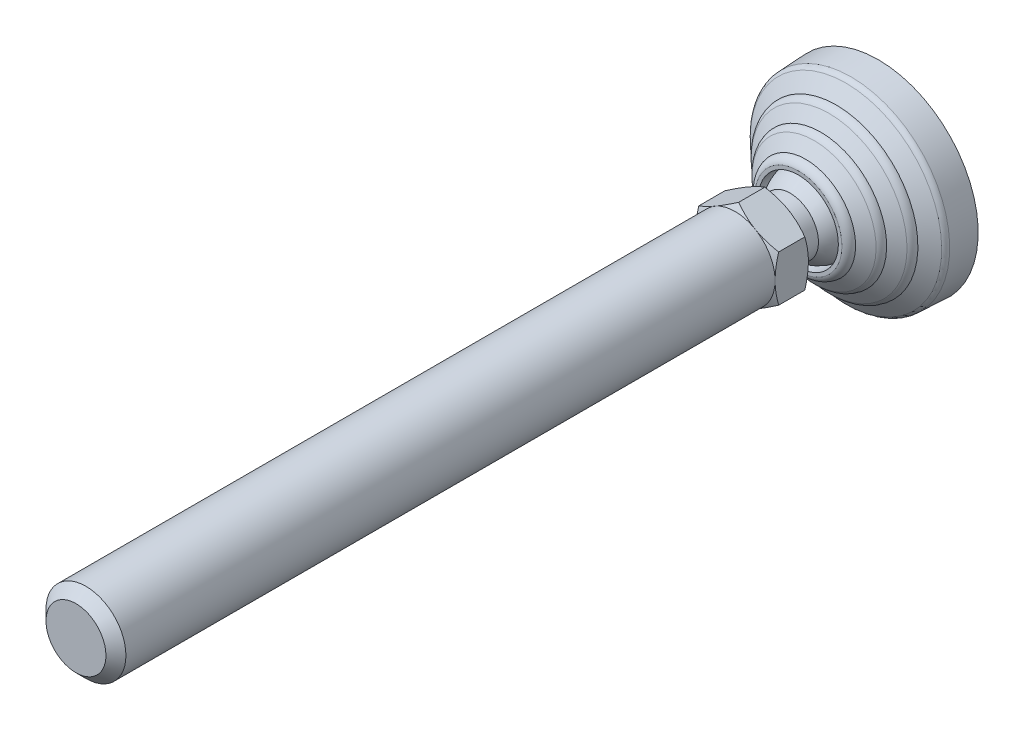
ISO-10303-21;
HEADER;
FILE_DESCRIPTION(('STEP AP214'),'2;1');
FILE_NAME('part.step','',(''),(''),'','','');
FILE_SCHEMA(('AUTOMOTIVE_DESIGN { 1 0 10303 214 1 1 1 1 }'));
ENDSEC;
DATA;
#1=APPLICATION_CONTEXT('core data for automotive mechanical design processes');
#2=APPLICATION_PROTOCOL_DEFINITION('international standard','automotive_design',2000,#1);
#3=PRODUCT_CONTEXT('',#1,'mechanical');
#4=PRODUCT('Part','Part','',(#3));
#5=PRODUCT_RELATED_PRODUCT_CATEGORY('part','',(#4));
#6=PRODUCT_DEFINITION_FORMATION('','',#4);
#7=PRODUCT_DEFINITION_CONTEXT('part definition',#1,'design');
#8=PRODUCT_DEFINITION('design','',#6,#7);
#9=PRODUCT_DEFINITION_SHAPE('','',#8);
#10=(LENGTH_UNIT() NAMED_UNIT(*) SI_UNIT(.MILLI.,.METRE.));
#11=(NAMED_UNIT(*) PLANE_ANGLE_UNIT() SI_UNIT($,.RADIAN.));
#12=(NAMED_UNIT(*) SI_UNIT($,.STERADIAN.) SOLID_ANGLE_UNIT());
#13=UNCERTAINTY_MEASURE_WITH_UNIT(LENGTH_MEASURE(1.E-05),#10,'distance_accuracy_value','');
#14=(GEOMETRIC_REPRESENTATION_CONTEXT(3) GLOBAL_UNCERTAINTY_ASSIGNED_CONTEXT((#13)) GLOBAL_UNIT_ASSIGNED_CONTEXT((#10,
#11,#12)) REPRESENTATION_CONTEXT('',''));
#15=CARTESIAN_POINT('',(0.,0.,0.));
#16=DIRECTION('',(0.,0.,1.));
#17=DIRECTION('',(1.,0.,0.));
#18=AXIS2_PLACEMENT_3D('',#15,#16,#17);
#19=CARTESIAN_POINT('',(0.,0.,30.));
#20=DIRECTION('',(0.,0.,-1.));
#21=DIRECTION('',(0.,1.,0.));
#22=AXIS2_PLACEMENT_3D('',#19,#20,#21);
#23=CYLINDRICAL_SURFACE('',#22,12.);
#24=CARTESIAN_POINT('',(-12.,0.,18.));
#25=CARTESIAN_POINT('',(-12.0000041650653,-0.196349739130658,18.));
#26=CARTESIAN_POINT('',(-11.9951810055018,-0.392699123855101,18.));
#27=CARTESIAN_POINT('',(-11.9759099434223,-0.784925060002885,18.));
#28=CARTESIAN_POINT('',(-11.9614620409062,-0.980801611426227,18.));
#29=CARTESIAN_POINT('',(-11.9229713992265,-1.37160975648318,18.));
#30=CARTESIAN_POINT('',(-11.8989286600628,-1.5665413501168,18.));
#31=CARTESIAN_POINT('',(-11.841307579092,-1.95499003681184,18.));
#32=CARTESIAN_POINT('',(-11.8077292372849,-2.14850712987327,18.));
#33=CARTESIAN_POINT('',(-11.7311174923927,-2.53366059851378,18.));
#34=CARTESIAN_POINT('',(-11.6880840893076,-2.72529697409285,18.));
#35=CARTESIAN_POINT('',(-11.5926659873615,-3.10622734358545,18.));
#36=CARTESIAN_POINT('',(-11.5402812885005,-3.29552133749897,18.));
#37=CARTESIAN_POINT('',(-11.4262867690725,-3.67131091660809,18.));
#38=CARTESIAN_POINT('',(-11.3646769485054,-3.85780650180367,18.));
#39=CARTESIAN_POINT('',(-11.2323806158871,-4.22754997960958,18.));
#40=CARTESIAN_POINT('',(-11.1616941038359,-4.41079787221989,18.));
#41=CARTESIAN_POINT('',(-11.011414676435,-4.77360450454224,18.));
#42=CARTESIAN_POINT('',(-10.9318217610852,-4.95316324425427,18.));
#43=CARTESIAN_POINT('',(-10.7639212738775,-5.30815899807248,18.));
#44=CARTESIAN_POINT('',(-10.6756137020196,-5.48359601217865,18.));
#45=CARTESIAN_POINT('',(-10.4904966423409,-5.82992567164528,17.9999999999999));
#46=CARTESIAN_POINT('',(-10.3936871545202,-6.00081831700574,17.9999999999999));
#47=CARTESIAN_POINT('',(-10.1917994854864,-6.33764754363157,17.9999999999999));
#48=CARTESIAN_POINT('',(-10.0867213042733,-6.50358412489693,17.9999999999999));
#49=CARTESIAN_POINT('',(-9.8685493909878,-6.83010146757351,17.9999999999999));
#50=CARTESIAN_POINT('',(-9.75545565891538,-6.99068222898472,17.9999999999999));
#51=CARTESIAN_POINT('',(-9.5215250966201,-7.30610107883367,17.9999999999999));
#52=CARTESIAN_POINT('',(-9.40068826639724,-7.4609391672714,17.9999999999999));
#53=CARTESIAN_POINT('',(-9.15156261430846,-7.76449965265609,17.9999999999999));
#54=CARTESIAN_POINT('',(-9.02327379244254,-7.91322204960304,17.9999999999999));
#55=CARTESIAN_POINT('',(-8.75955321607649,-8.20419286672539,17.9999999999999));
#56=CARTESIAN_POINT('',(-8.62412146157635,-8.3464412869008,17.9999999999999));
#57=CARTESIAN_POINT('',(-8.3464412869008,-8.62412146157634,17.9999999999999));
#58=CARTESIAN_POINT('',(-8.2041928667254,-8.75955321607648,17.9999999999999));
#59=CARTESIAN_POINT('',(-7.91322204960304,-9.02327379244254,17.9999999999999));
#60=CARTESIAN_POINT('',(-7.76449965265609,-9.15156261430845,17.9999999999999));
#61=CARTESIAN_POINT('',(-7.4609391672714,-9.40068826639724,17.9999999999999));
#62=CARTESIAN_POINT('',(-7.30610107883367,-9.5215250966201,17.9999999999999));
#63=CARTESIAN_POINT('',(-6.99068222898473,-9.75545565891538,17.9999999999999));
#64=CARTESIAN_POINT('',(-6.83010146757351,-9.8685493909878,17.9999999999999));
#65=CARTESIAN_POINT('',(-6.50358412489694,-10.0867213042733,17.9999999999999));
#66=CARTESIAN_POINT('',(-6.33764754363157,-10.1917994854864,17.9999999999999));
#67=CARTESIAN_POINT('',(-6.00081831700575,-10.3936871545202,17.9999999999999));
#68=CARTESIAN_POINT('',(-5.82992567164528,-10.4904966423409,17.9999999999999));
#69=CARTESIAN_POINT('',(-5.48359601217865,-10.6756137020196,17.9999999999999));
#70=CARTESIAN_POINT('',(-5.30815899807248,-10.7639212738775,17.9999999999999));
#71=CARTESIAN_POINT('',(-4.95316324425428,-10.9318217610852,17.9999999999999));
#72=CARTESIAN_POINT('',(-4.77360450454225,-11.011414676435,17.9999999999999));
#73=CARTESIAN_POINT('',(-4.4107978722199,-11.1616941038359,17.9999999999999));
#74=CARTESIAN_POINT('',(-4.22754997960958,-11.2323806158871,17.9999999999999));
#75=CARTESIAN_POINT('',(-3.85780650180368,-11.3646769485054,17.9999999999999));
#76=CARTESIAN_POINT('',(-3.67131091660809,-11.4262867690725,17.9999999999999));
#77=CARTESIAN_POINT('',(-3.29552133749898,-11.5402812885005,17.9999999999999));
#78=CARTESIAN_POINT('',(-3.10622734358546,-11.5926659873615,17.9999999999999));
#79=CARTESIAN_POINT('',(-2.72529697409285,-11.6880840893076,17.9999999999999));
#80=CARTESIAN_POINT('',(-2.53366059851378,-11.7311174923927,17.9999999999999));
#81=CARTESIAN_POINT('',(-2.14850712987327,-11.8077292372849,17.9999999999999));
#82=CARTESIAN_POINT('',(-1.95499003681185,-11.841307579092,17.9999999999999));
#83=CARTESIAN_POINT('',(-1.5665413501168,-11.8989286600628,17.9999999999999));
#84=CARTESIAN_POINT('',(-1.37160975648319,-11.9229713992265,17.9999999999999));
#85=CARTESIAN_POINT('',(-0.980801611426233,-11.9614620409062,17.9999999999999));
#86=CARTESIAN_POINT('',(-0.78492506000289,-11.9759099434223,17.9999999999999));
#87=CARTESIAN_POINT('',(-0.392699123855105,-11.9951810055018,17.9999999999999));
#88=CARTESIAN_POINT('',(-0.196349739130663,-12.0000041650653,17.9999999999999));
#89=CARTESIAN_POINT('',(0.,-12.,17.9999999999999));
#90=B_SPLINE_CURVE_WITH_KNOTS('',3,(#24,#25,#26,#27,#28,#29,#30,#31,#32,#33,#34,#35,#36,#37,#38,
#39,#40,#41,#42,#43,#44,#45,#46,#47,#48,#49,#50,#51,#52,#53,#54,#55,#56,#57,#58,#59,#60,#61,#62,
#63,#64,#65,#66,#67,#68,#69,#70,#71,#72,#73,#74,#75,#76,#77,#78,#79,#80,#81,#82,#83,#84,#85,#86,
#87,#88,#89),.UNSPECIFIED.,.F.,.F.,(4,2,2,2,2,2,2,2,2,2,2,2,2,2,2,2,2,2,2,2,2,2,2,2,2,2,2,2,2,2,
2,2,4),(0.,0.588989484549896,1.17797896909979,1.76696845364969,2.35595793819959,
2.94494742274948,3.53393690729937,4.12292639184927,4.71191587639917,5.30090536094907,
5.88989484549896,6.47888433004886,7.06787381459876,7.65686329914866,8.24585278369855,
8.83484226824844,9.42383175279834,10.0128212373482,10.6018107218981,11.190800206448,
11.7797896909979,12.3687791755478,12.9577686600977,13.5467581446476,14.1357476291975,
14.7247371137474,15.3137265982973,15.9027160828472,16.4917055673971,17.080695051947,
17.6696845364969,18.2586740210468,18.8476635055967),.UNSPECIFIED.);
#91=CARTESIAN_POINT('',(-12.,0.,18.00017943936));
#92=VERTEX_POINT('',#91);
#93=CARTESIAN_POINT('',(0.,-12.,18.));
#94=VERTEX_POINT('',#93);
#95=EDGE_CURVE('E138',#92,#94,#90,.T.);
#96=ORIENTED_EDGE('',*,*,#95,.F.);
#97=CARTESIAN_POINT('',(0.,0.,18.));
#98=DIRECTION('',(0.,0.,-1.));
#99=DIRECTION('',(0.,1.,0.));
#100=AXIS2_PLACEMENT_3D('',#97,#98,#99);
#101=CIRCLE('',#100,12.);
#102=CARTESIAN_POINT('',(0.,12.,18.));
#103=VERTEX_POINT('',#102);
#104=EDGE_CURVE('E134',#103,#92,#101,.F.);
#105=ORIENTED_EDGE('',*,*,#104,.F.);
#106=CARTESIAN_POINT('',(12.,0.,18.));
#107=CARTESIAN_POINT('',(12.0000041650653,0.196349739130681,18.));
#108=CARTESIAN_POINT('',(11.9951810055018,0.392699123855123,18.));
#109=CARTESIAN_POINT('',(11.9759099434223,0.784925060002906,18.));
#110=CARTESIAN_POINT('',(11.9614620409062,0.980801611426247,18.));
#111=CARTESIAN_POINT('',(11.9229713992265,1.3716097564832,18.));
#112=CARTESIAN_POINT('',(11.8989286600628,1.56654135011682,18.));
#113=CARTESIAN_POINT('',(11.841307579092,1.95499003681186,18.));
#114=CARTESIAN_POINT('',(11.8077292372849,2.14850712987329,18.));
#115=CARTESIAN_POINT('',(11.7311174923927,2.53366059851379,18.));
#116=CARTESIAN_POINT('',(11.6880840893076,2.72529697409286,18.));
#117=CARTESIAN_POINT('',(11.5926659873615,3.10622734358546,18.));
#118=CARTESIAN_POINT('',(11.5402812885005,3.29552133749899,18.));
#119=CARTESIAN_POINT('',(11.4262867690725,3.6713109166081,18.));
#120=CARTESIAN_POINT('',(11.3646769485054,3.85780650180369,18.));
#121=CARTESIAN_POINT('',(11.2323806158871,4.22754997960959,18.));
#122=CARTESIAN_POINT('',(11.1616941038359,4.4107978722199,18.));
#123=CARTESIAN_POINT('',(11.011414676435,4.77360450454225,18.));
#124=CARTESIAN_POINT('',(10.9318217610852,4.95316324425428,18.));
#125=CARTESIAN_POINT('',(10.7639212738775,5.30815899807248,18.));
#126=CARTESIAN_POINT('',(10.6756137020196,5.48359601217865,18.));
#127=CARTESIAN_POINT('',(10.4904966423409,5.82992567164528,18.));
#128=CARTESIAN_POINT('',(10.3936871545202,6.00081831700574,18.));
#129=CARTESIAN_POINT('',(10.1917994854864,6.33764754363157,18.));
#130=CARTESIAN_POINT('',(10.0867213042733,6.50358412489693,18.));
#131=CARTESIAN_POINT('',(9.8685493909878,6.83010146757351,18.));
#132=CARTESIAN_POINT('',(9.75545565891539,6.99068222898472,18.));
#133=CARTESIAN_POINT('',(9.5215250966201,7.30610107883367,18.));
#134=CARTESIAN_POINT('',(9.40068826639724,7.4609391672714,18.));
#135=CARTESIAN_POINT('',(9.15156261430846,7.76449965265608,18.));
#136=CARTESIAN_POINT('',(9.02327379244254,7.91322204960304,18.));
#137=CARTESIAN_POINT('',(8.75955321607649,8.20419286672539,18.));
#138=CARTESIAN_POINT('',(8.62412146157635,8.3464412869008,18.));
#139=CARTESIAN_POINT('',(8.34644128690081,8.62412146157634,18.));
#140=CARTESIAN_POINT('',(8.20419286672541,8.75955321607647,18.));
#141=CARTESIAN_POINT('',(7.91322204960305,9.02327379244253,18.));
#142=CARTESIAN_POINT('',(7.7644996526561,9.15156261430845,18.));
#143=CARTESIAN_POINT('',(7.46093916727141,9.40068826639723,18.));
#144=CARTESIAN_POINT('',(7.30610107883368,9.52152509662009,18.));
#145=CARTESIAN_POINT('',(6.99068222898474,9.75545565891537,18.));
#146=CARTESIAN_POINT('',(6.83010146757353,9.86854939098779,18.));
#147=CARTESIAN_POINT('',(6.50358412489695,10.0867213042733,18.));
#148=CARTESIAN_POINT('',(6.33764754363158,10.1917994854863,18.));
#149=CARTESIAN_POINT('',(6.00081831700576,10.3936871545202,18.));
#150=CARTESIAN_POINT('',(5.8299256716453,10.4904966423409,18.));
#151=CARTESIAN_POINT('',(5.48359601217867,10.6756137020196,18.));
#152=CARTESIAN_POINT('',(5.3081589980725,10.7639212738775,18.));
#153=CARTESIAN_POINT('',(4.9531632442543,10.9318217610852,18.));
#154=CARTESIAN_POINT('',(4.77360450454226,11.0114146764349,18.));
#155=CARTESIAN_POINT('',(4.41079787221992,11.1616941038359,18.));
#156=CARTESIAN_POINT('',(4.2275499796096,11.2323806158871,18.));
#157=CARTESIAN_POINT('',(3.85780650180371,11.3646769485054,18.));
#158=CARTESIAN_POINT('',(3.67131091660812,11.4262867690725,18.));
#159=CARTESIAN_POINT('',(3.29552133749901,11.5402812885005,18.));
#160=CARTESIAN_POINT('',(3.10622734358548,11.5926659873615,18.));
#161=CARTESIAN_POINT('',(2.72529697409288,11.6880840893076,18.));
#162=CARTESIAN_POINT('',(2.53366059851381,11.7311174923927,18.));
#163=CARTESIAN_POINT('',(2.1485071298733,11.8077292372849,18.));
#164=CARTESIAN_POINT('',(1.95499003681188,11.841307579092,18.));
#165=CARTESIAN_POINT('',(1.56654135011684,11.8989286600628,18.));
#166=CARTESIAN_POINT('',(1.37160975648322,11.9229713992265,18.));
#167=CARTESIAN_POINT('',(0.980801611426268,11.9614620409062,18.));
#168=CARTESIAN_POINT('',(0.784925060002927,11.9759099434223,18.));
#169=CARTESIAN_POINT('',(0.392699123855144,11.9951810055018,18.));
#170=CARTESIAN_POINT('',(0.196349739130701,12.0000041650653,18.));
#171=CARTESIAN_POINT('',(0.,12.,18.));
#172=B_SPLINE_CURVE_WITH_KNOTS('',3,(#106,#107,#108,#109,#110,#111,#112,#113,#114,#115,#116,
#117,#118,#119,#120,#121,#122,#123,#124,#125,#126,#127,#128,#129,#130,#131,#132,#133,#134,#135,
#136,#137,#138,#139,#140,#141,#142,#143,#144,#145,#146,#147,#148,#149,#150,#151,#152,#153,#154,
#155,#156,#157,#158,#159,#160,#161,#162,#163,#164,#165,#166,#167,#168,#169,#170,#171),
.UNSPECIFIED.,.F.,.F.,(4,2,2,2,2,2,2,2,2,2,2,2,2,2,2,2,2,2,2,2,2,2,2,2,2,2,2,2,2,2,2,2,4),(0.,
0.588989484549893,1.17797896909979,1.76696845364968,2.35595793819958,2.94494742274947,
3.53393690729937,4.12292639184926,4.71191587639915,5.30090536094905,5.88989484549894,
6.47888433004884,7.06787381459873,7.65686329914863,8.24585278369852,8.83484226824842,
9.42383175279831,10.0128212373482,10.6018107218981,11.190800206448,11.7797896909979,
12.3687791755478,12.9577686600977,13.5467581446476,14.1357476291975,14.7247371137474,
15.3137265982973,15.9027160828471,16.491705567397,17.0806950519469,17.6696845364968,
18.2586740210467,18.8476635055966),.UNSPECIFIED.);
#173=CARTESIAN_POINT('',(12.,0.,18.));
#174=VERTEX_POINT('',#173);
#175=EDGE_CURVE('E31',#174,#103,#172,.T.);
#176=ORIENTED_EDGE('',*,*,#175,.F.);
#177=CARTESIAN_POINT('',(0.,0.,18.));
#178=DIRECTION('',(0.,0.,-1.));
#179=DIRECTION('',(0.,1.,0.));
#180=AXIS2_PLACEMENT_3D('',#177,#178,#179);
#181=CIRCLE('',#180,12.);
#182=EDGE_CURVE('E135',#94,#174,#181,.F.);
#183=ORIENTED_EDGE('',*,*,#182,.F.);
#184=EDGE_LOOP('',(#96,#105,#176,#183));
#185=FACE_BOUND('',#184,.T.);
#186=CARTESIAN_POINT('',(0.,0.,24.));
#187=DIRECTION('',(0.,0.,-1.));
#188=DIRECTION('',(0.,1.,0.));
#189=AXIS2_PLACEMENT_3D('',#186,#187,#188);
#190=CIRCLE('',#189,12.);
#191=CARTESIAN_POINT('',(0.,12.,24.));
#192=VERTEX_POINT('',#191);
#193=EDGE_CURVE('E155',#192,#192,#190,.T.);
#194=ORIENTED_EDGE('',*,*,#193,.F.);
#195=EDGE_LOOP('',(#194));
#196=FACE_BOUND('',#195,.T.);
#197=ADVANCED_FACE('F14',(#185,#196),#23,.F.);
#198=CARTESIAN_POINT('',(-6.53226682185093,0.,24.));
#199=DIRECTION('',(0.,0.,1.));
#200=DIRECTION('',(-1.,0.,0.));
#201=AXIS2_PLACEMENT_3D('',#198,#199,#200);
#202=PLANE('',#201);
#203=CARTESIAN_POINT('',(0.,0.,24.));
#204=DIRECTION('',(0.,0.,-1.));
#205=DIRECTION('',(0.,1.,0.));
#206=AXIS2_PLACEMENT_3D('',#203,#204,#205);
#207=CIRCLE('',#206,13.0645336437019);
#208=CARTESIAN_POINT('',(0.,13.0645336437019,24.));
#209=VERTEX_POINT('',#208);
#210=EDGE_CURVE('E151',#209,#209,#207,.T.);
#211=ORIENTED_EDGE('',*,*,#210,.F.);
#212=EDGE_LOOP('',(#211));
#213=FACE_BOUND('',#212,.T.);
#214=ORIENTED_EDGE('',*,*,#193,.T.);
#215=EDGE_LOOP('',(#214));
#216=FACE_BOUND('',#215,.T.);
#217=ADVANCED_FACE('F304',(#213,#216),#202,.T.);
#218=CARTESIAN_POINT('',(0.,0.,21.5842));
#219=DIRECTION('',(0.,0.,-1.));
#220=DIRECTION('',(0.,1.,0.));
#221=AXIS2_PLACEMENT_3D('',#218,#219,#220);
#222=TOROIDAL_SURFACE('',#221,12.5253,2.47525);
#223=ORIENTED_EDGE('',*,*,#210,.T.);
#224=EDGE_LOOP('',(#223));
#225=FACE_BOUND('',#224,.T.);
#226=CARTESIAN_POINT('',(0.,0.,21.8062186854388));
#227=DIRECTION('',(0.,0.,-1.));
#228=DIRECTION('',(-1.,0.,0.));
#229=AXIS2_PLACEMENT_3D('',#226,#227,#228);
#230=CIRCLE('',#229,14.9905728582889);
#231=CARTESIAN_POINT('',(-14.9905728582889,0.,21.8062186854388));
#232=VERTEX_POINT('',#231);
#233=EDGE_CURVE('E154',#232,#232,#230,.T.);
#234=ORIENTED_EDGE('',*,*,#233,.F.);
#235=EDGE_LOOP('',(#234));
#236=FACE_BOUND('',#235,.T.);
#237=ADVANCED_FACE('F382',(#225,#236),#222,.T.);
#238=CARTESIAN_POINT('',(0.,0.,19.3004110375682));
#239=DIRECTION('',(0.,0.,-1.));
#240=DIRECTION('',(0.,1.,0.));
#241=AXIS2_PLACEMENT_3D('',#238,#239,#240);
#242=CONICAL_SURFACE('',#241,18.63040749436,0.967870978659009);
#243=ORIENTED_EDGE('',*,*,#233,.T.);
#244=EDGE_LOOP('',(#243));
#245=FACE_BOUND('',#244,.T.);
#246=CARTESIAN_POINT('',(0.,0.,19.3004110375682));
#247=DIRECTION('',(0.,0.,-1.));
#248=DIRECTION('',(0.,1.,0.));
#249=AXIS2_PLACEMENT_3D('',#246,#247,#248);
#250=CIRCLE('',#249,18.63040749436);
#251=CARTESIAN_POINT('',(0.,18.63040749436,19.3004110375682));
#252=VERTEX_POINT('',#251);
#253=EDGE_CURVE('E376',#252,#252,#250,.T.);
#254=ORIENTED_EDGE('',*,*,#253,.F.);
#255=EDGE_LOOP('',(#254));
#256=FACE_BOUND('',#255,.T.);
#257=ADVANCED_FACE('F369',(#245,#256),#242,.T.);
#258=CARTESIAN_POINT('',(0.,0.,17.149417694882));
#259=DIRECTION('',(0.,0.,-1.));
#260=DIRECTION('',(0.,1.,0.));
#261=AXIS2_PLACEMENT_3D('',#258,#259,#260);
#262=TOROIDAL_SURFACE('',#261,17.1699621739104,2.59993709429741);
#263=CARTESIAN_POINT('',(0.,0.,17.266146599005));
#264=DIRECTION('',(0.,0.,-1.));
#265=DIRECTION('',(-1.,0.,0.));
#266=AXIS2_PLACEMENT_3D('',#263,#264,#265);
#267=CIRCLE('',#266,19.7672775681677);
#268=CARTESIAN_POINT('',(-19.7672775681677,0.,17.266146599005));
#269=VERTEX_POINT('',#268);
#270=EDGE_CURVE('E373',#269,#269,#267,.T.);
#271=ORIENTED_EDGE('',*,*,#270,.F.);
#272=EDGE_LOOP('',(#271));
#273=FACE_BOUND('',#272,.T.);
#274=ORIENTED_EDGE('',*,*,#253,.T.);
#275=EDGE_LOOP('',(#274));
#276=FACE_BOUND('',#275,.T.);
#277=ADVANCED_FACE('F365',(#273,#276),#262,.T.);
#278=CARTESIAN_POINT('',(0.,0.,14.7704000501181));
#279=DIRECTION('',(0.,0.,-1.));
#280=DIRECTION('',(0.,1.,0.));
#281=AXIS2_PLACEMENT_3D('',#278,#279,#280);
#282=CONICAL_SURFACE('',#281,23.3925000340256,0.967871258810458);
#283=CARTESIAN_POINT('',(0.,0.,14.7704000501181));
#284=DIRECTION('',(0.,0.,-1.));
#285=DIRECTION('',(0.,1.,0.));
#286=AXIS2_PLACEMENT_3D('',#283,#284,#285);
#287=CIRCLE('',#286,23.3925000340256);
#288=CARTESIAN_POINT('',(0.,23.3925000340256,14.7704000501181));
#289=VERTEX_POINT('',#288);
#290=EDGE_CURVE('E354',#289,#289,#287,.T.);
#291=ORIENTED_EDGE('',*,*,#290,.F.);
#292=EDGE_LOOP('',(#291));
#293=FACE_BOUND('',#292,.T.);
#294=ORIENTED_EDGE('',*,*,#270,.T.);
#295=EDGE_LOOP('',(#294));
#296=FACE_BOUND('',#295,.T.);
#297=ADVANCED_FACE('F361',(#293,#296),#282,.T.);
#298=CARTESIAN_POINT('',(0.,0.,12.6193000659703));
#299=DIRECTION('',(0.,0.,-1.));
#300=DIRECTION('',(0.,1.,0.));
#301=AXIS2_PLACEMENT_3D('',#298,#299,#300);
#302=TOROIDAL_SURFACE('',#301,21.9321002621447,2.59999973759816);
#303=ORIENTED_EDGE('',*,*,#290,.T.);
#304=EDGE_LOOP('',(#303));
#305=FACE_BOUND('',#304,.T.);
#306=CARTESIAN_POINT('',(0.,0.,12.6295138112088));
#307=DIRECTION('',(0.,0.,-1.));
#308=DIRECTION('',(-1.,0.,0.));
#309=AXIS2_PLACEMENT_3D('',#306,#307,#308);
#310=CIRCLE('',#309,24.5320799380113);
#311=CARTESIAN_POINT('',(-24.5320799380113,0.,12.6295138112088));
#312=VERTEX_POINT('',#311);
#313=EDGE_CURVE('E351',#312,#312,#310,.T.);
#314=ORIENTED_EDGE('',*,*,#313,.F.);
#315=EDGE_LOOP('',(#314));
#316=FACE_BOUND('',#315,.T.);
#317=ADVANCED_FACE('F358',(#305,#316),#302,.T.);
#318=CARTESIAN_POINT('',(0.,0.,9.71835625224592));
#319=DIRECTION('',(0.,0.,-1.));
#320=DIRECTION('',(0.,1.,0.));
#321=AXIS2_PLACEMENT_3D('',#318,#319,#320);
#322=CONICAL_SURFACE('',#321,28.760790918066,0.967879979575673);
#323=ORIENTED_EDGE('',*,*,#313,.T.);
#324=EDGE_LOOP('',(#323));
#325=FACE_BOUND('',#324,.T.);
#326=CARTESIAN_POINT('',(0.,0.,9.71835625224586));
#327=DIRECTION('',(0.,0.,-1.));
#328=DIRECTION('',(0.,1.,0.));
#329=AXIS2_PLACEMENT_3D('',#326,#327,#328);
#330=CIRCLE('',#329,28.760790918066);
#331=CARTESIAN_POINT('',(0.,28.760790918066,9.71835625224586));
#332=VERTEX_POINT('',#331);
#333=EDGE_CURVE('E348',#332,#332,#330,.T.);
#334=ORIENTED_EDGE('',*,*,#333,.F.);
#335=EDGE_LOOP('',(#334));
#336=FACE_BOUND('',#335,.T.);
#337=ADVANCED_FACE('F341',(#325,#336),#322,.T.);
#338=CARTESIAN_POINT('',(0.,0.,8.07109690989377));
#339=DIRECTION('',(0.,0.,-1.));
#340=DIRECTION('',(0.,1.,0.));
#341=AXIS2_PLACEMENT_3D('',#338,#339,#340);
#342=TOROIDAL_SURFACE('',#341,27.6268354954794,1.9998295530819);
#343=CARTESIAN_POINT('',(0.,0.,8.17566154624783));
#344=DIRECTION('',(0.,0.,-1.));
#345=DIRECTION('',(-1.,0.,0.));
#346=AXIS2_PLACEMENT_3D('',#343,#344,#345);
#347=CIRCLE('',#346,29.6239295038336);
#348=CARTESIAN_POINT('',(-29.6239295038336,0.,8.17566154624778));
#349=VERTEX_POINT('',#348);
#350=EDGE_CURVE('E150',#349,#349,#347,.T.);
#351=ORIENTED_EDGE('',*,*,#350,.F.);
#352=EDGE_LOOP('',(#351));
#353=FACE_BOUND('',#352,.T.);
#354=ORIENTED_EDGE('',*,*,#333,.T.);
#355=EDGE_LOOP('',(#354));
#356=FACE_BOUND('',#355,.T.);
#357=ADVANCED_FACE('F336',(#353,#356),#342,.T.);
#358=CARTESIAN_POINT('',(0.,0.,0.));
#359=DIRECTION('',(0.,0.,-1.));
#360=DIRECTION('',(0.,1.,0.));
#361=AXIS2_PLACEMENT_3D('',#358,#359,#360);
#362=CONICAL_SURFACE('',#361,30.,0.0459663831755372);
#363=CARTESIAN_POINT('',(0.,0.,0.));
#364=DIRECTION('',(0.,0.,-1.));
#365=DIRECTION('',(0.,1.,0.));
#366=AXIS2_PLACEMENT_3D('',#363,#364,#365);
#367=CIRCLE('',#366,30.);
#368=CARTESIAN_POINT('',(0.,30.,0.));
#369=VERTEX_POINT('',#368);
#370=EDGE_CURVE('E147',#369,#369,#367,.T.);
#371=ORIENTED_EDGE('',*,*,#370,.F.);
#372=EDGE_LOOP('',(#371));
#373=FACE_BOUND('',#372,.T.);
#374=ORIENTED_EDGE('',*,*,#350,.T.);
#375=EDGE_LOOP('',(#374));
#376=FACE_BOUND('',#375,.T.);
#377=ADVANCED_FACE('F296',(#373,#376),#362,.T.);
#378=CARTESIAN_POINT('',(-15.,0.,0.));
#379=DIRECTION('',(0.,0.,-1.));
#380=DIRECTION('',(0.,1.,0.));
#381=AXIS2_PLACEMENT_3D('',#378,#379,#380);
#382=PLANE('',#381);
#383=ORIENTED_EDGE('',*,*,#370,.T.);
#384=EDGE_LOOP('',(#383));
#385=FACE_BOUND('',#384,.T.);
#386=ADVANCED_FACE('F117',(#385),#382,.T.);
#387=CARTESIAN_POINT('',(0.,0.,90.1595));
#388=DIRECTION('',(0.,0.,-1.));
#389=DIRECTION('',(0.,1.,0.));
#390=AXIS2_PLACEMENT_3D('',#387,#388,#389);
#391=CYLINDRICAL_SURFACE('',#390,12.);
#392=CARTESIAN_POINT('',(0.,0.,238.));
#393=DIRECTION('',(0.,0.,1.));
#394=DIRECTION('',(0.,-1.,0.));
#395=AXIS2_PLACEMENT_3D('',#392,#393,#394);
#396=CIRCLE('',#395,12.);
#397=CARTESIAN_POINT('',(0.,-12.,238.));
#398=VERTEX_POINT('',#397);
#399=EDGE_CURVE('E9',#398,#398,#396,.F.);
#400=ORIENTED_EDGE('',*,*,#399,.T.);
#401=EDGE_LOOP('',(#400));
#402=FACE_BOUND('',#401,.T.);
#403=CARTESIAN_POINT('',(0.,0.,43.));
#404=DIRECTION('',(0.,0.,-1.));
#405=DIRECTION('',(0.,1.,0.));
#406=AXIS2_PLACEMENT_3D('',#403,#404,#405);
#407=CIRCLE('',#406,12.);
#408=CARTESIAN_POINT('',(0.,12.,43.));
#409=VERTEX_POINT('',#408);
#410=EDGE_CURVE('E136',#409,#409,#407,.F.);
#411=ORIENTED_EDGE('',*,*,#410,.T.);
#412=EDGE_LOOP('',(#411));
#413=FACE_BOUND('',#412,.T.);
#414=ADVANCED_FACE('F287',(#402,#413),#391,.T.);
#415=CARTESIAN_POINT('',(11.995,0.,43.));
#416=DIRECTION('',(0.,0.,-1.));
#417=DIRECTION('',(0.,1.,0.));
#418=AXIS2_PLACEMENT_3D('',#415,#416,#417);
#419=PLANE('',#418);
#420=CARTESIAN_POINT('',(0.,0.,43.));
#421=DIRECTION('',(0.,0.,-1.));
#422=DIRECTION('',(0.,1.,0.));
#423=AXIS2_PLACEMENT_3D('',#420,#421,#422);
#424=CIRCLE('',#423,11.99);
#425=CARTESIAN_POINT('',(0.,11.99,43.));
#426=VERTEX_POINT('',#425);
#427=EDGE_CURVE('E575',#426,#426,#424,.F.);
#428=ORIENTED_EDGE('',*,*,#427,.T.);
#429=EDGE_LOOP('',(#428));
#430=FACE_BOUND('',#429,.T.);
#431=ORIENTED_EDGE('',*,*,#410,.F.);
#432=EDGE_LOOP('',(#431));
#433=FACE_BOUND('',#432,.T.);
#434=ADVANCED_FACE('F254',(#430,#433),#419,.T.);
#435=CARTESIAN_POINT('',(0.,0.,41.9159643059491));
#436=DIRECTION('',(0.,0.,-1.));
#437=DIRECTION('',(0.,1.,0.));
#438=AXIS2_PLACEMENT_3D('',#435,#436,#437);
#439=CONICAL_SURFACE('',#438,13.8676048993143,1.0471975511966);
#440=ORIENTED_EDGE('',*,*,#427,.F.);
#441=EDGE_LOOP('',(#440));
#442=FACE_BOUND('',#441,.T.);
#443=CARTESIAN_POINT('',(-2.30779106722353E-08,13.856406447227,41.9224297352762));
#444=CARTESIAN_POINT('',(-0.263784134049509,13.7041106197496,42.0103407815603));
#445=CARTESIAN_POINT('',(-0.528551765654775,13.5512469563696,42.0942615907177));
#446=CARTESIAN_POINT('',(-1.06021024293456,13.2442937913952,42.2530155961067));
#447=CARTESIAN_POINT('',(-1.32710175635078,13.0902039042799,42.3278458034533));
#448=CARTESIAN_POINT('',(-2.13207652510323,12.6254515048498,42.5372522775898));
#449=CARTESIAN_POINT('',(-2.6733374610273,12.3129543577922,42.656360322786));
#450=CARTESIAN_POINT('',(-3.48330959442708,11.8453167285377,42.7960231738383));
#451=CARTESIAN_POINT('',(-3.74960112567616,11.6915732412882,42.8358073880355));
#452=CARTESIAN_POINT('',(-4.28341703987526,11.3833744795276,42.9025217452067));
#453=CARTESIAN_POINT('',(-4.550941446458,11.2289191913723,42.9294516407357));
#454=CARTESIAN_POINT('',(-5.08643618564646,10.9197511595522,42.9697675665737));
#455=CARTESIAN_POINT('',(-5.35440560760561,10.7650389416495,42.9831696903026));
#456=CARTESIAN_POINT('',(-5.89059263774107,10.4554712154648,42.9961444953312));
#457=CARTESIAN_POINT('',(-6.15881023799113,10.300615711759,42.9957176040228));
#458=CARTESIAN_POINT('',(-6.66023033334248,10.0111206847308,42.9820002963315));
#459=CARTESIAN_POINT('',(-6.89346861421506,9.87646050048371,42.9703830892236));
#460=CARTESIAN_POINT('',(-7.359408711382,9.60744985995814,42.9369099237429));
#461=CARTESIAN_POINT('',(-7.59211048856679,9.4730994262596,42.9150532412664));
#462=CARTESIAN_POINT('',(-8.05685112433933,9.20478129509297,42.8614821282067));
#463=CARTESIAN_POINT('',(-8.28888927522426,9.07081400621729,42.8297595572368));
#464=CARTESIAN_POINT('',(-8.75187778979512,8.8035074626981,42.7570131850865));
#465=CARTESIAN_POINT('',(-8.98282807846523,8.67016825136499,42.7159887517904));
#466=CARTESIAN_POINT('',(-9.68388988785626,8.26541002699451,42.5779256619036));
#467=CARTESIAN_POINT('',(-10.1519713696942,7.9951630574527,42.4671213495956));
#468=CARTESIAN_POINT('',(-11.0811551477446,7.45869855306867,42.2156417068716));
#469=CARTESIAN_POINT('',(-11.5422693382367,7.19247415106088,42.0750254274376));
#470=CARTESIAN_POINT('',(-11.9999999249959,6.92820327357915,41.922429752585));
#471=B_SPLINE_CURVE_WITH_KNOTS('',3,(#443,#444,#445,#446,#447,#448,#449,#450,#451,#452,#453,
#454,#455,#456,#457,#458,#459,#460,#461,#462,#463,#464,#465,#466,#467,#468,#469,#470),
.UNSPECIFIED.,.F.,.F.,(4,2,2,2,2,2,2,2,2,2,2,2,2,4),(0.,0.950996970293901,1.90230577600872,
3.80897260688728,4.73890630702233,5.6688579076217,6.59770187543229,7.52651713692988,
8.33503480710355,9.14360966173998,9.95285345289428,10.7621522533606,12.4163367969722,
14.0672748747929),.UNSPECIFIED.);
#472=CARTESIAN_POINT('',(-1.15389586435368E-08,13.856406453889,41.92242973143));
#473=VERTEX_POINT('',#472);
#474=CARTESIAN_POINT('',(-12.,6.92820324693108,41.9224297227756));
#475=VERTEX_POINT('',#474);
#476=EDGE_CURVE('E100',#473,#475,#471,.T.);
#477=ORIENTED_EDGE('',*,*,#476,.T.);
#478=CARTESIAN_POINT('',(-12.,6.92820326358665,41.9224297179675));
#479=CARTESIAN_POINT('',(-12.,6.64374493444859,42.0045333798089));
#480=CARTESIAN_POINT('',(-12.,6.35829458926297,42.0831531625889));
#481=CARTESIAN_POINT('',(-12.,5.78524260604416,42.2325348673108));
#482=CARTESIAN_POINT('',(-12.,5.49764024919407,42.3032940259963));
#483=CARTESIAN_POINT('',(-12.,4.63053083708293,42.5026195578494));
#484=CARTESIAN_POINT('',(-12.,4.04782834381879,42.6179071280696));
#485=CARTESIAN_POINT('',(-12.,3.17548925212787,42.7575170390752));
#486=CARTESIAN_POINT('',(-12.,2.88840964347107,42.7982045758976));
#487=CARTESIAN_POINT('',(-12.,2.31290718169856,42.8685767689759));
#488=CARTESIAN_POINT('',(-12.,2.02448443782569,42.8982623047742));
#489=CARTESIAN_POINT('',(-12.,1.44696804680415,42.9459902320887));
#490=CARTESIAN_POINT('',(-12.,1.15787537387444,42.9640443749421));
#491=CARTESIAN_POINT('',(-12.,0.579188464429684,42.9881624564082));
#492=CARTESIAN_POINT('',(-12.,0.289594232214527,42.994226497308));
#493=CARTESIAN_POINT('',(-12.,-0.289594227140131,42.9942264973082));
#494=CARTESIAN_POINT('',(-12.,-0.579188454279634,42.9881624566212));
#495=CARTESIAN_POINT('',(-12.,-1.15787535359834,42.9640443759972));
#496=CARTESIAN_POINT('',(-12.,-1.44696802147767,42.9459902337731));
#497=CARTESIAN_POINT('',(-12.,-2.02448440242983,42.8982623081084));
#498=CARTESIAN_POINT('',(-12.,-2.31290714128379,42.8685767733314));
#499=CARTESIAN_POINT('',(-12.,-2.88840959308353,42.798204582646));
#500=CARTESIAN_POINT('',(-12.,-3.17548919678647,42.7575170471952));
#501=CARTESIAN_POINT('',(-12.,-4.04782827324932,42.6179071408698));
#502=CARTESIAN_POINT('',(-12.,-4.63053075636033,42.5026195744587));
#503=CARTESIAN_POINT('',(-12.,-5.49764015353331,42.3032940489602));
#504=CARTESIAN_POINT('',(-12.,-5.78524250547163,42.2325348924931));
#505=CARTESIAN_POINT('',(-12.,-6.35829447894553,42.0831531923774));
#506=CARTESIAN_POINT('',(-12.,-6.64374481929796,42.004533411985));
#507=CARTESIAN_POINT('',(-12.,-6.92820314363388,41.9224297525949));
#508=B_SPLINE_CURVE_WITH_KNOTS('',3,(#478,#479,#480,#481,#482,#483,#484,#485,#486,#487,#488,
#489,#490,#491,#492,#493,#494,#495,#496,#497,#498,#499,#500,#501,#502,#503,#504,#505,#506,#507),
.UNSPECIFIED.,.F.,.F.,(4,2,2,2,2,2,2,2,2,2,2,2,2,2,4),(0.,0.888148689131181,1.77660860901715,
3.55698615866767,4.42666281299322,5.2962699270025,6.16499708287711,7.03371682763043,
7.90243655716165,8.7711636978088,9.64077079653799,10.5104474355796,12.2908249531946,
13.1792848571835,14.0674335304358),.UNSPECIFIED.);
#509=CARTESIAN_POINT('',(-12.0000000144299,-6.92820322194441,41.9224297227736));
#510=VERTEX_POINT('',#509);
#511=EDGE_CURVE('E268',#475,#510,#508,.T.);
#512=ORIENTED_EDGE('',*,*,#511,.T.);
#513=CARTESIAN_POINT('',(-12.0000000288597,-6.92820321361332,41.9224297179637));
#514=CARTESIAN_POINT('',(-11.7362159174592,-7.08049904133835,42.0103407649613));
#515=CARTESIAN_POINT('',(-11.471448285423,-7.23336270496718,42.0942615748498));
#516=CARTESIAN_POINT('',(-10.9397898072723,-7.54031587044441,42.2530155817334));
#517=CARTESIAN_POINT('',(-10.6728982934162,-7.69440575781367,42.3278457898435));
#518=CARTESIAN_POINT('',(-9.86792352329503,-8.15915815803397,42.5372522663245));
#519=CARTESIAN_POINT('',(-9.32666258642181,-8.47165530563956,42.6563603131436));
#520=CARTESIAN_POINT('',(-8.51669045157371,-8.93929293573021,42.7960231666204));
#521=CARTESIAN_POINT('',(-8.25039891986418,-9.09303642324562,42.8358073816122));
#522=CARTESIAN_POINT('',(-7.71658300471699,-9.40123518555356,42.9025217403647));
#523=CARTESIAN_POINT('',(-7.44905859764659,-9.55569047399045,42.9294516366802));
#524=CARTESIAN_POINT('',(-6.91356385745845,-9.8648585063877,42.9697675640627));
#525=CARTESIAN_POINT('',(-6.64559443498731,-10.019570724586,42.9831696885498));
#526=CARTESIAN_POINT('',(-6.10940740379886,-10.3291384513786,42.996144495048));
#527=CARTESIAN_POINT('',(-5.84118980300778,-10.4839939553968,42.9957176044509));
#528=CARTESIAN_POINT('',(-5.33976970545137,-10.7734889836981,42.9820002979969));
#529=CARTESIAN_POINT('',(-5.10653142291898,-10.9081491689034,42.9703830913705));
#530=CARTESIAN_POINT('',(-4.64059132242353,-11.1771598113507,42.9369099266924));
#531=CARTESIAN_POINT('',(-4.40788954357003,-11.3115102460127,42.9150532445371));
#532=CARTESIAN_POINT('',(-3.94314890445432,-11.5798283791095,42.8614821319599));
#533=CARTESIAN_POINT('',(-3.71111075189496,-11.7137956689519,42.829759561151));
#534=CARTESIAN_POINT('',(-3.24812223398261,-11.9811022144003,42.7570131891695));
#535=CARTESIAN_POINT('',(-3.01717194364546,-12.1144414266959,42.7159887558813));
#536=CARTESIAN_POINT('',(-2.31611012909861,-12.5191996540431,42.5779256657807));
#537=CARTESIAN_POINT('',(-1.84802864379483,-12.7894466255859,42.4671213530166));
#538=CARTESIAN_POINT('',(-0.918844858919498,-13.3259111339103,42.215641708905));
#539=CARTESIAN_POINT('',(-0.457730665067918,-13.5921355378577,42.0750254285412));
#540=CARTESIAN_POINT('',(-7.50040968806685E-08,-13.8564064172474,41.922429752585));
#541=B_SPLINE_CURVE_WITH_KNOTS('',3,(#513,#514,#515,#516,#517,#518,#519,#520,#521,#522,#523,
#524,#525,#526,#527,#528,#529,#530,#531,#532,#533,#534,#535,#536,#537,#538,#539,#540),
.UNSPECIFIED.,.F.,.F.,(4,2,2,2,2,2,2,2,2,2,2,2,2,4),(0.,0.950996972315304,1.90230578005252,
3.80897261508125,4.73890631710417,5.66885791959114,6.59770188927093,7.52651715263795,
8.33503482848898,9.14360968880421,9.95285348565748,10.7621522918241,12.4163368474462,
14.0672749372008),.UNSPECIFIED.);
#542=CARTESIAN_POINT('',(-1.44241383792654E-08,-13.8564064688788,41.9224297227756));
#543=VERTEX_POINT('',#542);
#544=EDGE_CURVE('E239',#510,#543,#541,.T.);
#545=ORIENTED_EDGE('',*,*,#544,.T.);
#546=CARTESIAN_POINT('',(-2.88482840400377E-08,-13.8564064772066,41.9224297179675));
#547=CARTESIAN_POINT('',(0.263784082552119,-13.7041106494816,42.0103407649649));
#548=CARTESIAN_POINT('',(0.528551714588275,-13.5512469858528,42.0942615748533));
#549=CARTESIAN_POINT('',(1.06021019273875,-13.2442938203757,42.2530155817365));
#550=CARTESIAN_POINT('',(1.32710170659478,-13.0902039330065,42.3278457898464));
#551=CARTESIAN_POINT('',(2.13207647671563,-12.6254515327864,42.537252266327));
#552=CARTESIAN_POINT('',(2.67333741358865,-12.3129543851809,42.6563603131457));
#553=CARTESIAN_POINT('',(3.48330954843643,-11.8453167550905,42.796023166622));
#554=CARTESIAN_POINT('',(3.74960108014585,-11.6915732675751,42.8358073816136));
#555=CARTESIAN_POINT('',(4.28341699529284,-11.3833745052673,42.9025217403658));
#556=CARTESIAN_POINT('',(4.55094140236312,-11.2289192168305,42.9294516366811));
#557=CARTESIAN_POINT('',(5.08643614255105,-10.9197511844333,42.9697675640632));
#558=CARTESIAN_POINT('',(5.35440556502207,-10.7650389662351,42.9831696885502));
#559=CARTESIAN_POINT('',(5.8905925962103,-10.4554712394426,42.996144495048));
#560=CARTESIAN_POINT('',(6.15881019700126,-10.3006157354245,42.9957176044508));
#561=CARTESIAN_POINT('',(6.66023029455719,-10.0111207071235,42.9820002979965));
#562=CARTESIAN_POINT('',(6.8934685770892,-9.87646052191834,42.97038309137));
#563=CARTESIAN_POINT('',(7.35940867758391,-9.60744987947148,42.9369099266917));
#564=CARTESIAN_POINT('',(7.59211045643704,-9.47309944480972,42.9150532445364));
#565=CARTESIAN_POINT('',(8.05685109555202,-9.20478131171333,42.8614821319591));
#566=CARTESIAN_POINT('',(8.28888924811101,-9.07081402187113,42.8297595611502));
#567=CARTESIAN_POINT('',(8.75187776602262,-8.80350747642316,42.7570131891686));
#568=CARTESIAN_POINT('',(8.9828280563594,-8.6701682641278,42.7159887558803));
#569=CARTESIAN_POINT('',(9.68388987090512,-8.26541003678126,42.5779256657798));
#570=CARTESIAN_POINT('',(10.1519713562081,-7.99516306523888,42.4671213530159));
#571=CARTESIAN_POINT('',(11.081155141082,-7.45869855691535,42.2156417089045));
#572=CARTESIAN_POINT('',(11.5422693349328,-7.19247415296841,42.075025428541));
#573=CARTESIAN_POINT('',(11.9999999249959,-6.92820327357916,41.922429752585));
#574=B_SPLINE_CURVE_WITH_KNOTS('',3,(#546,#547,#548,#549,#550,#551,#552,#553,#554,#555,#556,
#557,#558,#559,#560,#561,#562,#563,#564,#565,#566,#567,#568,#569,#570,#571,#572,#573),
.UNSPECIFIED.,.F.,.F.,(4,2,2,2,2,2,2,2,2,2,2,2,2,4),(0.,0.950996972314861,1.90230578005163,
3.80897261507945,4.73890631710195,5.66885791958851,6.59770188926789,7.52651715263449,
8.33503482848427,9.14360968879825,9.95285348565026,10.7621522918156,12.4163368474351,
14.0672749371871),.UNSPECIFIED.);
#575=CARTESIAN_POINT('',(12.,-6.92820324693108,41.9224297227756));
#576=VERTEX_POINT('',#575);
#577=EDGE_CURVE('E230',#543,#576,#574,.T.);
#578=ORIENTED_EDGE('',*,*,#577,.T.);
#579=CARTESIAN_POINT('',(12.,-6.92820326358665,41.9224297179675));
#580=CARTESIAN_POINT('',(12.,-6.64374493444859,42.0045333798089));
#581=CARTESIAN_POINT('',(12.,-6.35829458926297,42.0831531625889));
#582=CARTESIAN_POINT('',(12.,-5.78524260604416,42.2325348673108));
#583=CARTESIAN_POINT('',(12.,-5.49764024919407,42.3032940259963));
#584=CARTESIAN_POINT('',(12.,-4.63053083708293,42.5026195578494));
#585=CARTESIAN_POINT('',(12.,-4.04782834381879,42.6179071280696));
#586=CARTESIAN_POINT('',(12.,-3.17548925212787,42.7575170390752));
#587=CARTESIAN_POINT('',(12.,-2.88840964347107,42.7982045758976));
#588=CARTESIAN_POINT('',(12.,-2.31290718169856,42.8685767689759));
#589=CARTESIAN_POINT('',(12.,-2.02448443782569,42.8982623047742));
#590=CARTESIAN_POINT('',(12.,-1.44696804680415,42.9459902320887));
#591=CARTESIAN_POINT('',(12.,-1.15787537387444,42.9640443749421));
#592=CARTESIAN_POINT('',(12.,-0.579188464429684,42.9881624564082));
#593=CARTESIAN_POINT('',(12.,-0.289594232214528,42.994226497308));
#594=CARTESIAN_POINT('',(12.,0.289594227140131,42.9942264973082));
#595=CARTESIAN_POINT('',(12.,0.579188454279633,42.9881624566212));
#596=CARTESIAN_POINT('',(12.,1.15787535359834,42.9640443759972));
#597=CARTESIAN_POINT('',(12.,1.44696802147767,42.9459902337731));
#598=CARTESIAN_POINT('',(12.,2.02448440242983,42.8982623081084));
#599=CARTESIAN_POINT('',(12.,2.31290714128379,42.8685767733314));
#600=CARTESIAN_POINT('',(12.,2.88840959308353,42.798204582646));
#601=CARTESIAN_POINT('',(12.,3.17548919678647,42.7575170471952));
#602=CARTESIAN_POINT('',(12.,4.04782827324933,42.6179071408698));
#603=CARTESIAN_POINT('',(12.,4.63053075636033,42.5026195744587));
#604=CARTESIAN_POINT('',(12.,5.49764015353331,42.3032940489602));
#605=CARTESIAN_POINT('',(12.,5.78524250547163,42.2325348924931));
#606=CARTESIAN_POINT('',(12.,6.35829447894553,42.0831531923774));
#607=CARTESIAN_POINT('',(12.,6.64374481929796,42.004533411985));
#608=CARTESIAN_POINT('',(12.,6.92820314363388,41.9224297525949));
#609=B_SPLINE_CURVE_WITH_KNOTS('',3,(#579,#580,#581,#582,#583,#584,#585,#586,#587,#588,#589,
#590,#591,#592,#593,#594,#595,#596,#597,#598,#599,#600,#601,#602,#603,#604,#605,#606,#607,#608),
.UNSPECIFIED.,.F.,.F.,(4,2,2,2,2,2,2,2,2,2,2,2,2,2,4),(0.,0.888148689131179,1.77660860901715,
3.55698615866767,4.42666281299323,5.2962699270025,6.16499708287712,7.03371682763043,
7.90243655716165,8.7711636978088,9.64077079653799,10.5104474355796,12.2908249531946,
13.1792848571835,14.0674335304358),.UNSPECIFIED.);
#610=CARTESIAN_POINT('',(12.0000000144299,6.92820322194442,41.9224297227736));
#611=VERTEX_POINT('',#610);
#612=EDGE_CURVE('E238',#576,#611,#609,.T.);
#613=ORIENTED_EDGE('',*,*,#612,.T.);
#614=CARTESIAN_POINT('',(12.0000000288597,6.92820321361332,41.9224297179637));
#615=CARTESIAN_POINT('',(11.7362159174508,7.08049904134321,42.0103407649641));
#616=CARTESIAN_POINT('',(11.4714482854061,7.23336270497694,42.0942615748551));
#617=CARTESIAN_POINT('',(10.9397898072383,7.54031587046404,42.2530155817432));
#618=CARTESIAN_POINT('',(10.6728982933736,7.69440575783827,42.3278457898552));
#619=CARTESIAN_POINT('',(9.86792352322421,8.15915815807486,42.5372522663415));
#620=CARTESIAN_POINT('',(9.32666258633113,8.47165530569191,42.6563603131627));
#621=CARTESIAN_POINT('',(8.51669045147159,8.93929293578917,42.7960231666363));
#622=CARTESIAN_POINT('',(8.25039891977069,9.0930364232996,42.8358073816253));
#623=CARTESIAN_POINT('',(7.71658300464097,9.40123518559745,42.9025217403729));
#624=CARTESIAN_POINT('',(7.44905859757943,9.55569047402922,42.9294516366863));
#625=CARTESIAN_POINT('',(6.91356385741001,9.86485850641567,42.9697675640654));
#626=CARTESIAN_POINT('',(6.64559443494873,10.0195707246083,42.9831696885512));
#627=CARTESIAN_POINT('',(6.10940740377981,10.3291384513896,42.996144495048));
#628=CARTESIAN_POINT('',(5.84118980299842,10.4839939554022,42.9957176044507));
#629=CARTESIAN_POINT('',(5.33976970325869,10.773488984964,42.9820002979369));
#630=CARTESIAN_POINT('',(5.10653141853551,10.9081491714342,42.970383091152));
#631=CARTESIAN_POINT('',(4.64059131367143,11.1771598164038,42.9369099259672));
#632=CARTESIAN_POINT('',(4.4078895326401,11.3115102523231,42.9150532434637));
#633=CARTESIAN_POINT('',(3.94314888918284,11.5798283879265,42.8614821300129));
#634=CARTESIAN_POINT('',(3.71111073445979,11.7137956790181,42.8297595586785));
#635=CARTESIAN_POINT('',(3.24812221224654,11.9811022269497,42.7570131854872));
#636=CARTESIAN_POINT('',(3.01717191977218,12.1144414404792,42.7159887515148));
#637=CARTESIAN_POINT('',(2.31611009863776,12.5191996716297,42.5779256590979));
#638=CARTESIAN_POINT('',(1.84802860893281,12.7894466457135,42.4671213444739));
#639=CARTESIAN_POINT('',(0.918844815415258,13.3259111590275,42.2156416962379));
#640=CARTESIAN_POINT('',(0.457730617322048,13.5921355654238,42.0750254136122));
#641=CARTESIAN_POINT('',(2.30778996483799E-08,13.856406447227,41.9224297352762));
#642=B_SPLINE_CURVE_WITH_KNOTS('',3,(#614,#615,#616,#617,#618,#619,#620,#621,#622,#623,#624,
#625,#626,#627,#628,#629,#630,#631,#632,#633,#634,#635,#636,#637,#638,#639,#640,#641),
.UNSPECIFIED.,.F.,.F.,(4,2,2,2,2,2,2,2,2,2,2,2,2,4),(0.,0.95099697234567,1.9023057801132,
3.8089726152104,4.73890631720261,5.66885791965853,6.59770188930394,7.52651715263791,
8.33503483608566,9.14360970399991,9.95285350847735,10.7621523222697,12.4163368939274,
14.0672749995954),.UNSPECIFIED.);
#643=EDGE_CURVE('E259',#611,#473,#642,.T.);
#644=ORIENTED_EDGE('',*,*,#643,.T.);
#645=EDGE_LOOP('',(#477,#512,#545,#578,#613,#644));
#646=FACE_BOUND('',#645,.T.);
#647=ADVANCED_FACE('F250',(#442,#646),#439,.T.);
#648=CARTESIAN_POINT('',(0.,-13.856406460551,43.1));
#649=DIRECTION('',(0.5,0.866025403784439,0.));
#650=DIRECTION('',(-0.866025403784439,0.5,0.));
#651=AXIS2_PLACEMENT_3D('',#648,#649,#650);
#652=PLANE('',#651);
#653=DIRECTION('',(0.,0.,1.));
#654=VECTOR('',#653,1.);
#655=CARTESIAN_POINT('',(0.,-13.856406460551,43.1));
#656=LINE('',#655,#654);
#657=CARTESIAN_POINT('',(0.,-13.856406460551,34.0775702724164));
#658=VERTEX_POINT('',#657);
#659=EDGE_CURVE('E163',#658,#543,#656,.T.);
#660=ORIENTED_EDGE('',*,*,#659,.T.);
#661=ORIENTED_EDGE('',*,*,#544,.F.);
#662=DIRECTION('',(0.,0.,1.));
#663=VECTOR('',#662,1.);
#664=CARTESIAN_POINT('',(-12.,-6.9282032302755,43.1));
#665=LINE('',#664,#663);
#666=CARTESIAN_POINT('',(-12.,-6.9282032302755,34.0775702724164));
#667=VERTEX_POINT('',#666);
#668=EDGE_CURVE('E165',#667,#510,#665,.T.);
#669=ORIENTED_EDGE('',*,*,#668,.F.);
#670=CARTESIAN_POINT('',(0.,-13.856406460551,34.0775702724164));
#671=CARTESIAN_POINT('',(-0.263784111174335,-13.7041106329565,33.9896592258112));
#672=CARTESIAN_POINT('',(-0.528551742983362,-13.5512469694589,33.9057384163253));
#673=CARTESIAN_POINT('',(-1.0602102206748,-13.2442938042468,33.7469844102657));
#674=CARTESIAN_POINT('',(-1.32710173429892,-13.0902039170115,33.6721542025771));
#675=CARTESIAN_POINT('',(-2.13207650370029,-12.6254515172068,33.4627477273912));
#676=CARTESIAN_POINT('',(-2.67333744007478,-12.3129543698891,33.3436396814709));
#677=CARTESIAN_POINT('',(-3.48330957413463,-11.8453167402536,33.2039768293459));
#678=CARTESIAN_POINT('',(-3.74960110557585,-11.6915732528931,33.1641926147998));
#679=CARTESIAN_POINT('',(-4.28341702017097,-11.3833744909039,33.097478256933));
#680=CARTESIAN_POINT('',(-4.55094142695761,-11.2289192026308,33.0705483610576));
#681=CARTESIAN_POINT('',(-5.08643616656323,-10.9197511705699,33.0302324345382));
#682=CARTESIAN_POINT('',(-5.35440558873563,-10.765038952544,33.0168303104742));
#683=CARTESIAN_POINT('',(-5.89059261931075,-10.4554712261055,33.0038555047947));
#684=CARTESIAN_POINT('',(-6.15881021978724,-10.300615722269,33.0042823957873));
#685=CARTESIAN_POINT('',(-6.66023031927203,-10.0111206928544,33.0179997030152));
#686=CARTESIAN_POINT('',(-6.8934686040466,-9.87646050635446,33.029616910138));
#687=CARTESIAN_POINT('',(-7.35940870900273,-9.6074498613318,33.063090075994));
#688=CARTESIAN_POINT('',(-7.59211049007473,-9.47309942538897,33.0849467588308));
#689=CARTESIAN_POINT('',(-8.05685113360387,-9.20478128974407,33.1385178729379));
#690=CARTESIAN_POINT('',(-8.28888928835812,-9.07081399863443,33.1702404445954));
#691=CARTESIAN_POINT('',(-8.75187781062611,-8.8035074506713,33.2429868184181));
#692=CARTESIAN_POINT('',(-8.98282810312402,-8.67016823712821,33.2840112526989));
#693=CARTESIAN_POINT('',(-9.6838899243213,-8.2654100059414,33.4220743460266));
#694=CARTESIAN_POINT('',(-10.1519714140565,-7.99516303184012,33.5328786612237));
#695=CARTESIAN_POINT('',(-11.0811552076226,-7.45869851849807,33.7843583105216));
#696=CARTESIAN_POINT('',(-11.5422694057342,-7.19247411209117,33.924974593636));
#697=CARTESIAN_POINT('',(-12.,-6.9282032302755,34.0775702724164));
#698=B_SPLINE_CURVE_WITH_KNOTS('',3,(#670,#671,#672,#673,#674,#675,#676,#677,#678,#679,#680,
#681,#682,#683,#684,#685,#686,#687,#688,#689,#690,#691,#692,#693,#694,#695,#696,#697),
.UNSPECIFIED.,.F.,.F.,(4,2,2,2,2,2,2,2,2,2,2,2,2,4),(0.,0.950996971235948,1.90230577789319,
3.80897261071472,4.73890631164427,5.66885791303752,6.59770188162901,7.52651714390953,
8.33503482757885,9.14360969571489,9.9528535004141,10.7621523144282,12.4163368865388,
14.0672749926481),.UNSPECIFIED.);
#699=EDGE_CURVE('E164',#658,#667,#698,.T.);
#700=ORIENTED_EDGE('',*,*,#699,.F.);
#701=EDGE_LOOP('',(#660,#661,#669,#700));
#702=FACE_BOUND('',#701,.T.);
#703=ADVANCED_FACE('F222',(#702),#652,.F.);
#704=CARTESIAN_POINT('',(12.,-6.92820323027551,43.1));
#705=DIRECTION('',(-0.5,0.866025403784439,0.));
#706=DIRECTION('',(-0.866025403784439,-0.5,0.));
#707=AXIS2_PLACEMENT_3D('',#704,#705,#706);
#708=PLANE('',#707);
#709=DIRECTION('',(0.,0.,1.));
#710=VECTOR('',#709,1.);
#711=CARTESIAN_POINT('',(12.,-6.92820323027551,43.1));
#712=LINE('',#711,#710);
#713=CARTESIAN_POINT('',(12.,-6.92820323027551,34.0775702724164));
#714=VERTEX_POINT('',#713);
#715=EDGE_CURVE('E160',#714,#576,#712,.T.);
#716=ORIENTED_EDGE('',*,*,#715,.T.);
#717=ORIENTED_EDGE('',*,*,#577,.F.);
#718=ORIENTED_EDGE('',*,*,#659,.F.);
#719=CARTESIAN_POINT('',(12.,-6.92820323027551,34.0775702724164));
#720=CARTESIAN_POINT('',(11.7362158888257,-7.08049905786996,33.9896592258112));
#721=CARTESIAN_POINT('',(11.4714482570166,-7.2333627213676,33.9057384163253));
#722=CARTESIAN_POINT('',(10.9397897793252,-7.5403158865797,33.7469844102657));
#723=CARTESIAN_POINT('',(10.6728982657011,-7.69440577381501,33.6721542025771));
#724=CARTESIAN_POINT('',(9.86792349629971,-8.15915817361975,33.4627477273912));
#725=CARTESIAN_POINT('',(9.32666255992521,-8.4716553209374,33.3436396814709));
#726=CARTESIAN_POINT('',(8.51669042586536,-8.93929295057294,33.2039768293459));
#727=CARTESIAN_POINT('',(8.25039889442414,-9.09303643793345,33.1641926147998));
#728=CARTESIAN_POINT('',(7.71658297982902,-9.40123519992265,33.097478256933));
#729=CARTESIAN_POINT('',(7.44905857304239,-9.55569048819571,33.0705483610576));
#730=CARTESIAN_POINT('',(6.91356383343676,-9.86485852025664,33.0302324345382));
#731=CARTESIAN_POINT('',(6.64559441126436,-10.0195707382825,33.0168303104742));
#732=CARTESIAN_POINT('',(6.10940738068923,-10.329138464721,33.0038555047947));
#733=CARTESIAN_POINT('',(5.84118978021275,-10.4839939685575,33.0042823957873));
#734=CARTESIAN_POINT('',(5.33976968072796,-10.7734889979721,33.0179997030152));
#735=CARTESIAN_POINT('',(5.10653139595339,-10.9081491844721,33.029616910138));
#736=CARTESIAN_POINT('',(4.64059129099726,-11.1771598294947,33.063090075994));
#737=CARTESIAN_POINT('',(4.40788950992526,-11.3115102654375,33.0849467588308));
#738=CARTESIAN_POINT('',(3.94314886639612,-11.5798284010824,33.1385178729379));
#739=CARTESIAN_POINT('',(3.71111071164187,-11.7137956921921,33.1702404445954));
#740=CARTESIAN_POINT('',(3.24812218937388,-11.9811022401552,33.2429868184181));
#741=CARTESIAN_POINT('',(3.01717189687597,-12.1144414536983,33.2840112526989));
#742=CARTESIAN_POINT('',(2.3161100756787,-12.5191996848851,33.4220743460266));
#743=CARTESIAN_POINT('',(1.84802858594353,-12.7894466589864,33.5328786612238));
#744=CARTESIAN_POINT('',(0.918844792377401,-13.3259111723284,33.7843583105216));
#745=CARTESIAN_POINT('',(0.457730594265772,-13.5921355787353,33.924974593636));
#746=CARTESIAN_POINT('',(0.,-13.856406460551,34.0775702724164));
#747=B_SPLINE_CURVE_WITH_KNOTS('',3,(#719,#720,#721,#722,#723,#724,#725,#726,#727,#728,#729,
#730,#731,#732,#733,#734,#735,#736,#737,#738,#739,#740,#741,#742,#743,#744,#745,#746),
.UNSPECIFIED.,.F.,.F.,(4,2,2,2,2,2,2,2,2,2,2,2,2,4),(0.,0.95099697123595,1.90230577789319,
3.80897261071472,4.73890631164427,5.66885791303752,6.59770188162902,7.52651714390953,
8.33503482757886,9.14360969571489,9.9528535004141,10.7621523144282,12.4163368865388,
14.0672749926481),.UNSPECIFIED.);
#748=EDGE_CURVE('E162',#714,#658,#747,.T.);
#749=ORIENTED_EDGE('',*,*,#748,.F.);
#750=EDGE_LOOP('',(#716,#717,#718,#749));
#751=FACE_BOUND('',#750,.T.);
#752=ADVANCED_FACE('F219',(#751),#708,.F.);
#753=CARTESIAN_POINT('',(-12.,6.92820323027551,43.1));
#754=DIRECTION('',(0.5,-0.866025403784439,0.));
#755=DIRECTION('',(0.866025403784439,0.5,0.));
#756=AXIS2_PLACEMENT_3D('',#753,#754,#755);
#757=PLANE('',#756);
#758=DIRECTION('',(0.,0.,1.));
#759=VECTOR('',#758,1.);
#760=CARTESIAN_POINT('',(-12.,6.92820323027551,43.1));
#761=LINE('',#760,#759);
#762=CARTESIAN_POINT('',(-12.,6.92820323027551,34.0775702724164));
#763=VERTEX_POINT('',#762);
#764=EDGE_CURVE('E96',#763,#475,#761,.T.);
#765=ORIENTED_EDGE('',*,*,#764,.T.);
#766=ORIENTED_EDGE('',*,*,#476,.F.);
#767=DIRECTION('',(0.,0.,1.));
#768=VECTOR('',#767,1.);
#769=CARTESIAN_POINT('',(0.,13.856406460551,43.1));
#770=LINE('',#769,#768);
#771=CARTESIAN_POINT('',(0.,13.856406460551,34.0775702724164));
#772=VERTEX_POINT('',#771);
#773=EDGE_CURVE('E80',#772,#473,#770,.T.);
#774=ORIENTED_EDGE('',*,*,#773,.F.);
#775=CARTESIAN_POINT('',(-12.,6.92820323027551,34.0775702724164));
#776=CARTESIAN_POINT('',(-11.7362158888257,7.08049905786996,33.9896592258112));
#777=CARTESIAN_POINT('',(-11.4714482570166,7.2333627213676,33.9057384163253));
#778=CARTESIAN_POINT('',(-10.9397897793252,7.5403158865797,33.7469844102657));
#779=CARTESIAN_POINT('',(-10.6728982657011,7.69440577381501,33.6721542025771));
#780=CARTESIAN_POINT('',(-9.86792349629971,8.15915817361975,33.4627477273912));
#781=CARTESIAN_POINT('',(-9.32666255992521,8.4716553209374,33.3436396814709));
#782=CARTESIAN_POINT('',(-8.51669042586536,8.93929295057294,33.2039768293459));
#783=CARTESIAN_POINT('',(-8.25039889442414,9.09303643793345,33.1641926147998));
#784=CARTESIAN_POINT('',(-7.71658297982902,9.40123519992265,33.097478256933));
#785=CARTESIAN_POINT('',(-7.44905857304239,9.55569048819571,33.0705483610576));
#786=CARTESIAN_POINT('',(-6.91356383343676,9.86485852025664,33.0302324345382));
#787=CARTESIAN_POINT('',(-6.64559441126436,10.0195707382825,33.0168303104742));
#788=CARTESIAN_POINT('',(-6.10940738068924,10.329138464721,33.0038555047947));
#789=CARTESIAN_POINT('',(-5.84118978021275,10.4839939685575,33.0042823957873));
#790=CARTESIAN_POINT('',(-5.33976968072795,10.7734889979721,33.0179997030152));
#791=CARTESIAN_POINT('',(-5.10653139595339,10.9081491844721,33.029616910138));
#792=CARTESIAN_POINT('',(-4.64059129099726,11.1771598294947,33.063090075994));
#793=CARTESIAN_POINT('',(-4.40788950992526,11.3115102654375,33.0849467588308));
#794=CARTESIAN_POINT('',(-3.94314886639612,11.5798284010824,33.1385178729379));
#795=CARTESIAN_POINT('',(-3.71111071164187,11.7137956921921,33.1702404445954));
#796=CARTESIAN_POINT('',(-3.24812218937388,11.9811022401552,33.2429868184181));
#797=CARTESIAN_POINT('',(-3.01717189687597,12.1144414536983,33.2840112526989));
#798=CARTESIAN_POINT('',(-2.3161100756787,12.5191996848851,33.4220743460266));
#799=CARTESIAN_POINT('',(-1.84802858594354,12.7894466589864,33.5328786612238));
#800=CARTESIAN_POINT('',(-0.918844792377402,13.3259111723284,33.7843583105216));
#801=CARTESIAN_POINT('',(-0.457730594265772,13.5921355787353,33.924974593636));
#802=CARTESIAN_POINT('',(0.,13.856406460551,34.0775702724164));
#803=B_SPLINE_CURVE_WITH_KNOTS('',3,(#775,#776,#777,#778,#779,#780,#781,#782,#783,#784,#785,
#786,#787,#788,#789,#790,#791,#792,#793,#794,#795,#796,#797,#798,#799,#800,#801,#802),
.UNSPECIFIED.,.F.,.F.,(4,2,2,2,2,2,2,2,2,2,2,2,2,4),(0.,0.95099697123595,1.90230577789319,
3.80897261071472,4.73890631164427,5.66885791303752,6.59770188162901,7.52651714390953,
8.33503482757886,9.14360969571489,9.9528535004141,10.7621523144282,12.4163368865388,
14.0672749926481),.UNSPECIFIED.);
#804=EDGE_CURVE('E89',#763,#772,#803,.T.);
#805=ORIENTED_EDGE('',*,*,#804,.F.);
#806=EDGE_LOOP('',(#765,#766,#774,#805));
#807=FACE_BOUND('',#806,.T.);
#808=ADVANCED_FACE('F98',(#807),#757,.F.);
#809=CARTESIAN_POINT('',(-12.,-6.92820323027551,43.1));
#810=DIRECTION('',(1.,0.,0.));
#811=DIRECTION('',(0.,1.,0.));
#812=AXIS2_PLACEMENT_3D('',#809,#810,#811);
#813=PLANE('',#812);
#814=ORIENTED_EDGE('',*,*,#668,.T.);
#815=ORIENTED_EDGE('',*,*,#511,.F.);
#816=ORIENTED_EDGE('',*,*,#764,.F.);
#817=CARTESIAN_POINT('',(-12.,-6.9282032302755,34.0775702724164));
#818=CARTESIAN_POINT('',(-12.,-6.64374490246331,33.9954666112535));
#819=CARTESIAN_POINT('',(-12.,-6.35829455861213,33.9168468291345));
#820=CARTESIAN_POINT('',(-12.,-5.78524257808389,33.7674651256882));
#821=CARTESIAN_POINT('',(-12.,-5.49764022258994,33.6967059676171));
#822=CARTESIAN_POINT('',(-12.,-4.63053081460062,33.4973804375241));
#823=CARTESIAN_POINT('',(-12.,-4.04782832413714,33.3820928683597));
#824=CARTESIAN_POINT('',(-12.,-3.17548923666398,33.2424829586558));
#825=CARTESIAN_POINT('',(-12.,-2.88840962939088,33.2017954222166));
#826=CARTESIAN_POINT('',(-12.,-2.31290717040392,33.1314232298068));
#827=CARTESIAN_POINT('',(-12.,-2.02448442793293,33.1017376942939));
#828=CARTESIAN_POINT('',(-12.,-1.44696803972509,33.0540097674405));
#829=CARTESIAN_POINT('',(-12.,-1.1578753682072,33.035955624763));
#830=CARTESIAN_POINT('',(-12.,-0.579188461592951,33.0118375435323));
#831=CARTESIAN_POINT('',(-12.,-0.289594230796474,33.0057735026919));
#832=CARTESIAN_POINT('',(-12.,0.28959423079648,33.0057735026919));
#833=CARTESIAN_POINT('',(-12.,0.579188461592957,33.0118375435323));
#834=CARTESIAN_POINT('',(-12.,1.15787536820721,33.035955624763));
#835=CARTESIAN_POINT('',(-12.,1.4469680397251,33.0540097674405));
#836=CARTESIAN_POINT('',(-12.,2.02448442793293,33.1017376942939));
#837=CARTESIAN_POINT('',(-12.,2.31290717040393,33.1314232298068));
#838=CARTESIAN_POINT('',(-12.,2.88840962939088,33.2017954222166));
#839=CARTESIAN_POINT('',(-12.,3.17548923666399,33.2424829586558));
#840=CARTESIAN_POINT('',(-12.,4.04782832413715,33.3820928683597));
#841=CARTESIAN_POINT('',(-12.,4.63053081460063,33.4973804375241));
#842=CARTESIAN_POINT('',(-12.,5.49764022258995,33.6967059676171));
#843=CARTESIAN_POINT('',(-12.,5.7852425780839,33.7674651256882));
#844=CARTESIAN_POINT('',(-12.,6.35829455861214,33.9168468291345));
#845=CARTESIAN_POINT('',(-12.,6.64374490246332,33.9954666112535));
#846=CARTESIAN_POINT('',(-12.,6.92820323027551,34.0775702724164));
#847=B_SPLINE_CURVE_WITH_KNOTS('',3,(#817,#818,#819,#820,#821,#822,#823,#824,#825,#826,#827,
#828,#829,#830,#831,#832,#833,#834,#835,#836,#837,#838,#839,#840,#841,#842,#843,#844,#845,#846),
.UNSPECIFIED.,.F.,.F.,(4,2,2,2,2,2,2,2,2,2,2,2,2,2,4),(0.,0.888148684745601,1.77660860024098,
3.55698614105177,4.42666279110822,5.29626990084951,6.16499705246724,7.03371679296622,
7.90243653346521,8.77116368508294,9.64077079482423,10.5104474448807,12.2908249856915,
13.1792849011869,14.0674335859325),.UNSPECIFIED.);
#848=EDGE_CURVE('E92',#667,#763,#847,.T.);
#849=ORIENTED_EDGE('',*,*,#848,.F.);
#850=EDGE_LOOP('',(#814,#815,#816,#849));
#851=FACE_BOUND('',#850,.T.);
#852=ADVANCED_FACE('F188',(#851),#813,.F.);
#853=CARTESIAN_POINT('',(12.,6.92820323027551,43.1));
#854=DIRECTION('',(-1.,0.,0.));
#855=DIRECTION('',(0.,-1.,0.));
#856=AXIS2_PLACEMENT_3D('',#853,#854,#855);
#857=PLANE('',#856);
#858=DIRECTION('',(0.,0.,1.));
#859=VECTOR('',#858,1.);
#860=CARTESIAN_POINT('',(12.,6.92820323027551,43.1));
#861=LINE('',#860,#859);
#862=CARTESIAN_POINT('',(12.,6.9282032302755,34.0775702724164));
#863=VERTEX_POINT('',#862);
#864=EDGE_CURVE('E83',#611,#863,#861,.F.);
#865=ORIENTED_EDGE('',*,*,#864,.F.);
#866=ORIENTED_EDGE('',*,*,#612,.F.);
#867=ORIENTED_EDGE('',*,*,#715,.F.);
#868=CARTESIAN_POINT('',(12.,6.92820323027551,34.0775702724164));
#869=CARTESIAN_POINT('',(12.,6.64374490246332,33.9954666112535));
#870=CARTESIAN_POINT('',(12.,6.35829455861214,33.9168468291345));
#871=CARTESIAN_POINT('',(12.,5.7852425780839,33.7674651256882));
#872=CARTESIAN_POINT('',(12.,5.49764022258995,33.6967059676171));
#873=CARTESIAN_POINT('',(12.,4.63053081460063,33.4973804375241));
#874=CARTESIAN_POINT('',(12.,4.04782832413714,33.3820928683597));
#875=CARTESIAN_POINT('',(12.,3.17548923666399,33.2424829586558));
#876=CARTESIAN_POINT('',(12.,2.88840962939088,33.2017954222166));
#877=CARTESIAN_POINT('',(12.,2.31290717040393,33.1314232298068));
#878=CARTESIAN_POINT('',(12.,2.02448442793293,33.1017376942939));
#879=CARTESIAN_POINT('',(12.,1.4469680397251,33.0540097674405));
#880=CARTESIAN_POINT('',(12.,1.1578753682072,33.035955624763));
#881=CARTESIAN_POINT('',(12.,0.579188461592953,33.0118375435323));
#882=CARTESIAN_POINT('',(12.,0.289594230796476,33.0057735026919));
#883=CARTESIAN_POINT('',(12.,-0.289594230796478,33.0057735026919));
#884=CARTESIAN_POINT('',(12.,-0.579188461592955,33.0118375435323));
#885=CARTESIAN_POINT('',(12.,-1.15787536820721,33.035955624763));
#886=CARTESIAN_POINT('',(12.,-1.4469680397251,33.0540097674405));
#887=CARTESIAN_POINT('',(12.,-2.02448442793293,33.1017376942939));
#888=CARTESIAN_POINT('',(12.,-2.31290717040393,33.1314232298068));
#889=CARTESIAN_POINT('',(12.,-2.88840962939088,33.2017954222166));
#890=CARTESIAN_POINT('',(12.,-3.17548923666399,33.2424829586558));
#891=CARTESIAN_POINT('',(12.,-4.04782832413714,33.3820928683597));
#892=CARTESIAN_POINT('',(12.,-4.63053081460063,33.4973804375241));
#893=CARTESIAN_POINT('',(12.,-5.49764022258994,33.6967059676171));
#894=CARTESIAN_POINT('',(12.,-5.78524257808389,33.7674651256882));
#895=CARTESIAN_POINT('',(12.,-6.35829455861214,33.9168468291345));
#896=CARTESIAN_POINT('',(12.,-6.64374490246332,33.9954666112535));
#897=CARTESIAN_POINT('',(12.,-6.92820323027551,34.0775702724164));
#898=B_SPLINE_CURVE_WITH_KNOTS('',3,(#868,#869,#870,#871,#872,#873,#874,#875,#876,#877,#878,
#879,#880,#881,#882,#883,#884,#885,#886,#887,#888,#889,#890,#891,#892,#893,#894,#895,#896,#897),
.UNSPECIFIED.,.F.,.F.,(4,2,2,2,2,2,2,2,2,2,2,2,2,2,4),(0.,0.888148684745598,1.77660860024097,
3.55698614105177,4.42666279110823,5.29626990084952,6.16499705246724,7.03371679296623,
7.90243653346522,8.77116368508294,9.64077079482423,10.5104474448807,12.2908249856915,
13.1792849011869,14.0674335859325),.UNSPECIFIED.);
#899=EDGE_CURVE('E159',#863,#714,#898,.T.);
#900=ORIENTED_EDGE('',*,*,#899,.F.);
#901=EDGE_LOOP('',(#865,#866,#867,#900));
#902=FACE_BOUND('',#901,.T.);
#903=ADVANCED_FACE('F224',(#902),#857,.F.);
#904=CARTESIAN_POINT('',(0.,13.856406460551,43.1));
#905=DIRECTION('',(-0.5,-0.866025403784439,0.));
#906=DIRECTION('',(0.866025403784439,-0.5,0.));
#907=AXIS2_PLACEMENT_3D('',#904,#905,#906);
#908=PLANE('',#907);
#909=ORIENTED_EDGE('',*,*,#773,.T.);
#910=ORIENTED_EDGE('',*,*,#643,.F.);
#911=ORIENTED_EDGE('',*,*,#864,.T.);
#912=CARTESIAN_POINT('',(0.,13.856406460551,34.0775702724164));
#913=CARTESIAN_POINT('',(0.263784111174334,13.7041106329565,33.9896592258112));
#914=CARTESIAN_POINT('',(0.528551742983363,13.5512469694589,33.9057384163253));
#915=CARTESIAN_POINT('',(1.0602102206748,13.2442938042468,33.7469844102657));
#916=CARTESIAN_POINT('',(1.32710173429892,13.0902039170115,33.6721542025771));
#917=CARTESIAN_POINT('',(2.13207650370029,12.6254515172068,33.4627477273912));
#918=CARTESIAN_POINT('',(2.67333744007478,12.3129543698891,33.3436396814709));
#919=CARTESIAN_POINT('',(3.48330957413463,11.8453167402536,33.2039768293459));
#920=CARTESIAN_POINT('',(3.74960110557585,11.6915732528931,33.1641926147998));
#921=CARTESIAN_POINT('',(4.28341702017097,11.3833744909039,33.097478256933));
#922=CARTESIAN_POINT('',(4.55094142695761,11.2289192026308,33.0705483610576));
#923=CARTESIAN_POINT('',(5.08643616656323,10.9197511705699,33.0302324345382));
#924=CARTESIAN_POINT('',(5.35440558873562,10.765038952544,33.0168303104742));
#925=CARTESIAN_POINT('',(5.89059261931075,10.4554712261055,33.0038555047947));
#926=CARTESIAN_POINT('',(6.15881021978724,10.300615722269,33.0042823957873));
#927=CARTESIAN_POINT('',(6.66023031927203,10.0111206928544,33.0179997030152));
#928=CARTESIAN_POINT('',(6.8934686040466,9.87646050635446,33.029616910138));
#929=CARTESIAN_POINT('',(7.35940870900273,9.6074498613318,33.063090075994));
#930=CARTESIAN_POINT('',(7.59211049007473,9.47309942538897,33.0849467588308));
#931=CARTESIAN_POINT('',(8.05685113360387,9.20478128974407,33.1385178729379));
#932=CARTESIAN_POINT('',(8.28888928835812,9.07081399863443,33.1702404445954));
#933=CARTESIAN_POINT('',(8.75187781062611,8.8035074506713,33.2429868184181));
#934=CARTESIAN_POINT('',(8.98282810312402,8.67016823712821,33.2840112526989));
#935=CARTESIAN_POINT('',(9.6838899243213,8.2654100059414,33.4220743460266));
#936=CARTESIAN_POINT('',(10.1519714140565,7.99516303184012,33.5328786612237));
#937=CARTESIAN_POINT('',(11.0811552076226,7.45869851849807,33.7843583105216));
#938=CARTESIAN_POINT('',(11.5422694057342,7.19247411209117,33.924974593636));
#939=CARTESIAN_POINT('',(12.,6.9282032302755,34.0775702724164));
#940=B_SPLINE_CURVE_WITH_KNOTS('',3,(#912,#913,#914,#915,#916,#917,#918,#919,#920,#921,#922,
#923,#924,#925,#926,#927,#928,#929,#930,#931,#932,#933,#934,#935,#936,#937,#938,#939),
.UNSPECIFIED.,.F.,.F.,(4,2,2,2,2,2,2,2,2,2,2,2,2,4),(0.,0.950996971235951,1.90230577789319,
3.80897261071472,4.73890631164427,5.66885791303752,6.59770188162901,7.52651714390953,
8.33503482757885,9.14360969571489,9.9528535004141,10.7621523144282,12.4163368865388,
14.0672749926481),.UNSPECIFIED.);
#941=EDGE_CURVE('E75',#772,#863,#940,.T.);
#942=ORIENTED_EDGE('',*,*,#941,.F.);
#943=EDGE_LOOP('',(#909,#910,#911,#942));
#944=FACE_BOUND('',#943,.T.);
#945=ADVANCED_FACE('F77',(#944),#908,.F.);
#946=CARTESIAN_POINT('',(0.,0.,34.0840356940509));
#947=DIRECTION('',(0.,0.,1.));
#948=DIRECTION('',(0.,-1.,0.));
#949=AXIS2_PLACEMENT_3D('',#946,#947,#948);
#950=CONICAL_SURFACE('',#949,13.8676048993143,1.0471975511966);
#951=CARTESIAN_POINT('',(0.,0.,33.));
#952=DIRECTION('',(0.,0.,1.));
#953=DIRECTION('',(0.,-1.,0.));
#954=AXIS2_PLACEMENT_3D('',#951,#952,#953);
#955=CIRCLE('',#954,11.99);
#956=CARTESIAN_POINT('',(0.,-11.99,33.));
#957=VERTEX_POINT('',#956);
#958=EDGE_CURVE('E86',#957,#957,#955,.T.);
#959=ORIENTED_EDGE('',*,*,#958,.T.);
#960=EDGE_LOOP('',(#959));
#961=FACE_BOUND('',#960,.T.);
#962=ORIENTED_EDGE('',*,*,#848,.T.);
#963=ORIENTED_EDGE('',*,*,#804,.T.);
#964=ORIENTED_EDGE('',*,*,#941,.T.);
#965=ORIENTED_EDGE('',*,*,#899,.T.);
#966=ORIENTED_EDGE('',*,*,#748,.T.);
#967=ORIENTED_EDGE('',*,*,#699,.T.);
#968=EDGE_LOOP('',(#962,#963,#964,#965,#966,#967));
#969=FACE_BOUND('',#968,.T.);
#970=ADVANCED_FACE('F90',(#961,#969),#950,.T.);
#971=CARTESIAN_POINT('',(10.245,0.,33.));
#972=DIRECTION('',(0.,0.,-1.));
#973=DIRECTION('',(0.,1.,0.));
#974=AXIS2_PLACEMENT_3D('',#971,#972,#973);
#975=PLANE('',#974);
#976=CARTESIAN_POINT('',(0.,0.,33.));
#977=DIRECTION('',(0.,0.,-1.));
#978=DIRECTION('',(0.,1.,0.));
#979=AXIS2_PLACEMENT_3D('',#976,#977,#978);
#980=CIRCLE('',#979,8.5);
#981=CARTESIAN_POINT('',(0.,8.5,33.));
#982=VERTEX_POINT('',#981);
#983=EDGE_CURVE('E559',#982,#982,#980,.F.);
#984=ORIENTED_EDGE('',*,*,#983,.T.);
#985=EDGE_LOOP('',(#984));
#986=FACE_BOUND('',#985,.T.);
#987=ORIENTED_EDGE('',*,*,#958,.F.);
#988=EDGE_LOOP('',(#987));
#989=FACE_BOUND('',#988,.T.);
#990=ADVANCED_FACE('F193',(#986,#989),#975,.T.);
#991=CARTESIAN_POINT('',(0.,0.,29.7352685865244));
#992=DIRECTION('',(0.,0.,-1.));
#993=DIRECTION('',(0.,1.,0.));
#994=AXIS2_PLACEMENT_3D('',#991,#992,#993);
#995=CYLINDRICAL_SURFACE('',#994,8.5);
#996=ORIENTED_EDGE('',*,*,#983,.F.);
#997=EDGE_LOOP('',(#996));
#998=FACE_BOUND('',#997,.T.);
#999=CARTESIAN_POINT('',(0.,0.,26.4705371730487));
#1000=DIRECTION('',(0.,0.,-1.));
#1001=DIRECTION('',(0.,1.,0.));
#1002=AXIS2_PLACEMENT_3D('',#999,#1000,#1001);
#1003=CIRCLE('',#1002,8.5);
#1004=CARTESIAN_POINT('',(0.,8.5,26.4705371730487));
#1005=VERTEX_POINT('',#1004);
#1006=EDGE_CURVE('E562',#1005,#1005,#1003,.F.);
#1007=ORIENTED_EDGE('',*,*,#1006,.T.);
#1008=EDGE_LOOP('',(#1007));
#1009=FACE_BOUND('',#1008,.T.);
#1010=ADVANCED_FACE('F115',(#998,#1009),#995,.T.);
#1011=CARTESIAN_POINT('',(0.,0.,18.));
#1012=DIRECTION('',(1.,0.,0.));
#1013=DIRECTION('',(0.,0.,1.));
#1014=AXIS2_PLACEMENT_3D('',#1011,#1012,#1013);
#1015=SPHERICAL_SURFACE('',#1014,12.);
#1016=ORIENTED_EDGE('',*,*,#104,.T.);
#1017=ORIENTED_EDGE('',*,*,#95,.T.);
#1018=ORIENTED_EDGE('',*,*,#182,.T.);
#1019=ORIENTED_EDGE('',*,*,#175,.T.);
#1020=EDGE_LOOP('',(#1016,#1017,#1018,#1019));
#1021=FACE_BOUND('',#1020,.T.);
#1022=ORIENTED_EDGE('',*,*,#1006,.F.);
#1023=EDGE_LOOP('',(#1022));
#1024=FACE_BOUND('',#1023,.T.);
#1025=ADVANCED_FACE('F110',(#1021,#1024),#1015,.T.);
#1026=CARTESIAN_POINT('',(0.,0.,241.));
#1027=DIRECTION('',(0.,0.,1.));
#1028=DIRECTION('',(0.,-1.,0.));
#1029=AXIS2_PLACEMENT_3D('',#1026,#1027,#1028);
#1030=PLANE('',#1029);
#1031=CARTESIAN_POINT('',(0.,0.,241.));
#1032=DIRECTION('',(0.,0.,1.));
#1033=DIRECTION('',(0.,-1.,0.));
#1034=AXIS2_PLACEMENT_3D('',#1031,#1032,#1033);
#1035=CIRCLE('',#1034,9.);
#1036=CARTESIAN_POINT('',(0.,-9.,241.));
#1037=VERTEX_POINT('',#1036);
#1038=EDGE_CURVE('E23',#1037,#1037,#1035,.T.);
#1039=ORIENTED_EDGE('',*,*,#1038,.T.);
#1040=EDGE_LOOP('',(#1039));
#1041=FACE_BOUND('',#1040,.T.);
#1042=ADVANCED_FACE('F114',(#1041),#1030,.T.);
#1043=CARTESIAN_POINT('',(0.,0.,241.));
#1044=DIRECTION('',(0.,0.,-1.));
#1045=DIRECTION('',(0.,1.,0.));
#1046=AXIS2_PLACEMENT_3D('',#1043,#1044,#1045);
#1047=CONICAL_SURFACE('',#1046,9.,0.785398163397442);
#1048=ORIENTED_EDGE('',*,*,#399,.F.);
#1049=EDGE_LOOP('',(#1048));
#1050=FACE_BOUND('',#1049,.T.);
#1051=ORIENTED_EDGE('',*,*,#1038,.F.);
#1052=EDGE_LOOP('',(#1051));
#1053=FACE_BOUND('',#1052,.T.);
#1054=ADVANCED_FACE('F16',(#1050,#1053),#1047,.T.);
#1055=CLOSED_SHELL('',(#197,#217,#237,#257,#277,#297,#317,#337,#357,#377,#386,#414,#434,#647,
#703,#752,#808,#852,#903,#945,#970,#990,#1010,#1025,#1042,#1054));
#1056=MANIFOLD_SOLID_BREP('B1',#1055);
#1057=ADVANCED_BREP_SHAPE_REPRESENTATION('',(#18,#1056),#14);
#1058=SHAPE_DEFINITION_REPRESENTATION(#9,#1057);
ENDSEC;
END-ISO-10303-21;
